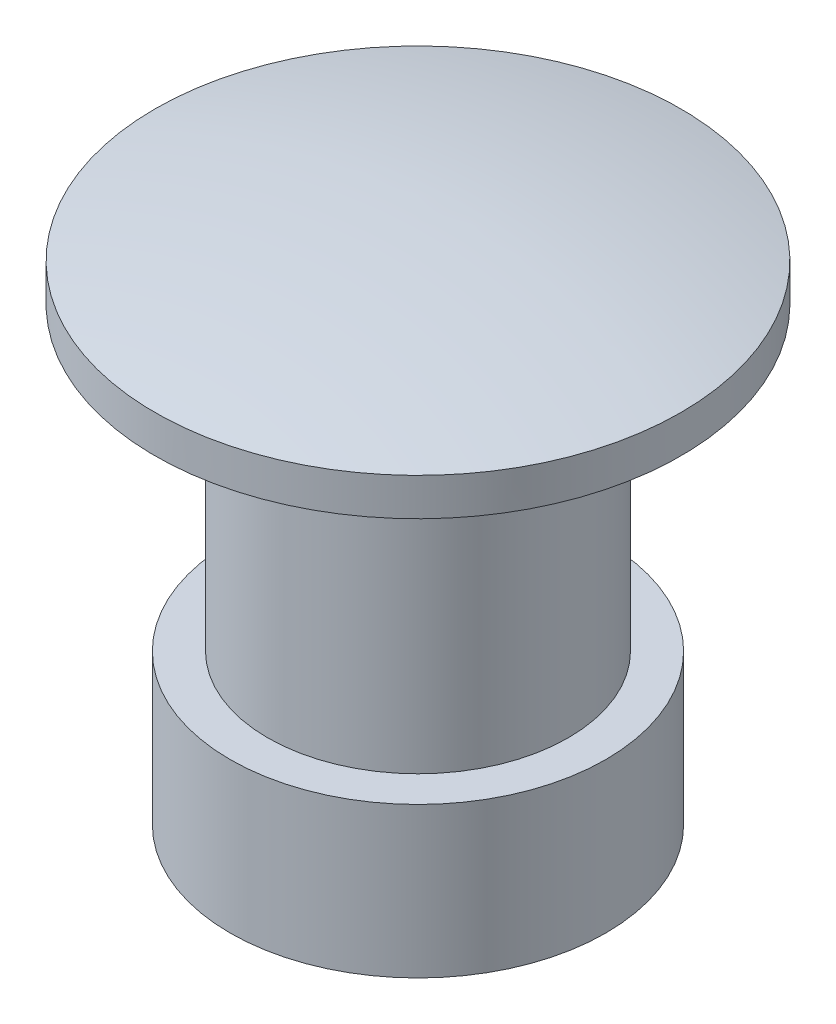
from build123d import *


with BuildPart() as part:
    # Esquisse1 → Base-R_volution (revolve)
    with BuildSketch(Plane.XY, mode=Mode.PRIVATE) as base_r_volution_sk:
        with BuildLine():
            Line((3.5, 0), (2, 0))
            Line((2, 0), (2, -4))
            Line((2, -4), (2.5, -4))
            Line((2.5, -4), (2.5, -6))
            Line((2.5, -6), (0, -6))
            Line((0, -6), (0, 0.914047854))
            ThreePointArc((0, 0.914047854), (1.762202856, 0.810176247), (3.5, 0.5))
            Line((3.5, 0.5), (3.5, 0))
        make_face()
    revolve(base_r_volution_sk.sketch.rotate(Axis((0, 8.642654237, 0), (0, -1, 0)), 180), axis=Axis((0, 8.642654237, 0), (0, -1, 0)))


solid = part.part
